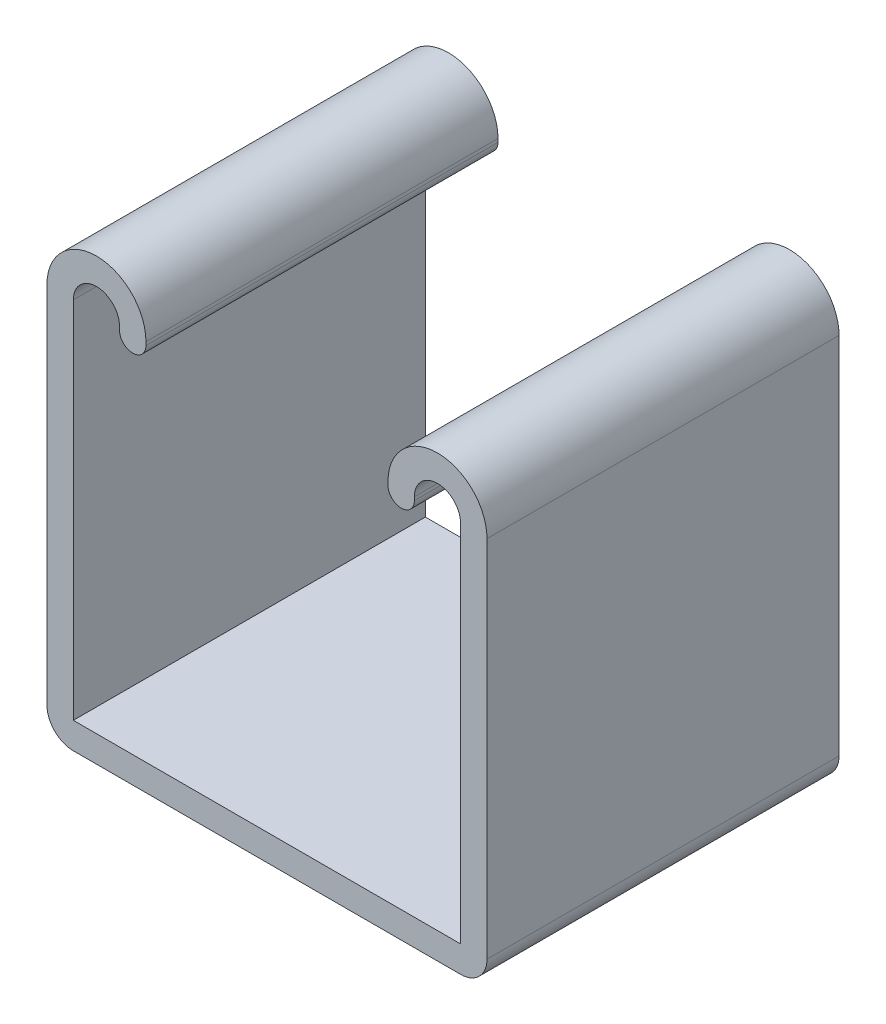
from build123d import *

# Parameters (mm, degrees)
BASE_EXTRUDE_DEPTH = 12.7


with BuildPart() as part:
    # Sketch1 → Base-Extrude (new, symmetric)
    with BuildSketch(Plane.XY):
        with BuildLine():
            Line((-15.875, 14.360525), (-15.875, -11.9126))
            ThreePointArc((-15.875, -11.9126), (-15.317038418, -13.259638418), (-13.97, -13.8176))
            Line((-13.97, -13.8176), (13.97, -13.8176))
            ThreePointArc((13.97, -13.8176), (15.317038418, -13.259638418), (15.875, -11.9126))
            Line((15.875, -11.9126), (15.875, 14.360525))
            ThreePointArc((15.875, 14.360525), (12.303125, 17.9324), (8.73125, 14.360525))
            Line((8.73125, 14.360525), (8.73125, 14.1224))
            ThreePointArc((8.73125, 14.1224), (9.68375, 13.1699), (10.63625, 14.1224))
            Line((10.63625, 14.1224), (10.63625, 14.360525))
            ThreePointArc((10.63625, 14.360525), (12.303125, 16.0274), (13.97, 14.360525))
            Line((13.97, 14.360525), (13.97, -11.9126))
            Line((13.97, -11.9126), (-13.97, -11.9126))
            Line((-13.97, -11.9126), (-13.97, 14.360525))
            ThreePointArc((-13.97, 14.360525), (-12.303125, 16.0274), (-10.63625, 14.360525))
            Line((-10.63625, 14.360525), (-10.63625, 14.1224))
            ThreePointArc((-10.63625, 14.1224), (-9.68375, 13.1699), (-8.73125, 14.1224))
            Line((-8.73125, 14.1224), (-8.73125, 14.360525))
            ThreePointArc((-8.73125, 14.360525), (-12.303125, 17.9324), (-15.875, 14.360525))
        make_face()
    extrude(amount=BASE_EXTRUDE_DEPTH, both=True)


solid = part.part
